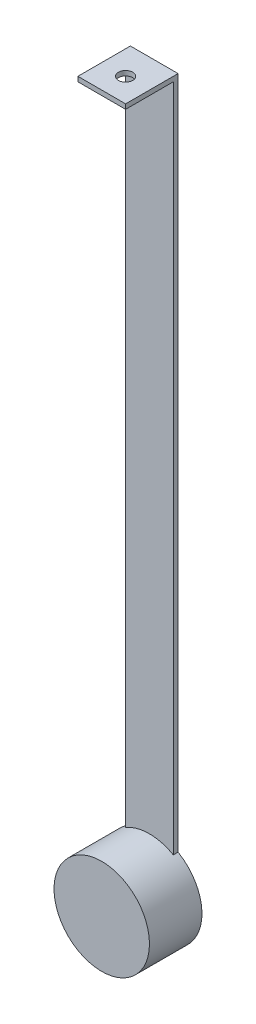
ISO-10303-21;
HEADER;
FILE_DESCRIPTION(('STEP AP214'),'2;1');
FILE_NAME('part.step','',(''),(''),'','','');
FILE_SCHEMA(('AUTOMOTIVE_DESIGN { 1 0 10303 214 1 1 1 1 }'));
ENDSEC;
DATA;
#1=APPLICATION_CONTEXT('core data for automotive mechanical design processes');
#2=APPLICATION_PROTOCOL_DEFINITION('international standard','automotive_design',2000,#1);
#3=PRODUCT_CONTEXT('',#1,'mechanical');
#4=PRODUCT('Part','Part','',(#3));
#5=PRODUCT_RELATED_PRODUCT_CATEGORY('part','',(#4));
#6=PRODUCT_DEFINITION_FORMATION('','',#4);
#7=PRODUCT_DEFINITION_CONTEXT('part definition',#1,'design');
#8=PRODUCT_DEFINITION('design','',#6,#7);
#9=PRODUCT_DEFINITION_SHAPE('','',#8);
#10=(LENGTH_UNIT() NAMED_UNIT(*) SI_UNIT(.MILLI.,.METRE.));
#11=(NAMED_UNIT(*) PLANE_ANGLE_UNIT() SI_UNIT($,.RADIAN.));
#12=(NAMED_UNIT(*) SI_UNIT($,.STERADIAN.) SOLID_ANGLE_UNIT());
#13=UNCERTAINTY_MEASURE_WITH_UNIT(LENGTH_MEASURE(1.E-05),#10,'distance_accuracy_value','');
#14=(GEOMETRIC_REPRESENTATION_CONTEXT(3) GLOBAL_UNCERTAINTY_ASSIGNED_CONTEXT((#13)) GLOBAL_UNIT_ASSIGNED_CONTEXT((#10,
#11,#12)) REPRESENTATION_CONTEXT('',''));
#15=CARTESIAN_POINT('',(0.,0.,0.));
#16=DIRECTION('',(0.,0.,1.));
#17=DIRECTION('',(1.,0.,0.));
#18=AXIS2_PLACEMENT_3D('',#15,#16,#17);
#19=CARTESIAN_POINT('',(0.,0.,1.));
#20=DIRECTION('',(0.,0.,1.));
#21=DIRECTION('',(1.,0.,0.));
#22=AXIS2_PLACEMENT_3D('',#19,#20,#21);
#23=PLANE('',#22);
#24=DIRECTION('',(0.,1.,0.));
#25=VECTOR('',#24,1.);
#26=CARTESIAN_POINT('',(5.,8.66025403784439,1.));
#27=LINE('',#26,#25);
#28=CARTESIAN_POINT('',(5.,8.66025403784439,1.));
#29=VERTEX_POINT('',#28);
#30=CARTESIAN_POINT('',(5.,149.,1.));
#31=VERTEX_POINT('',#30);
#32=EDGE_CURVE('E46',#29,#31,#27,.T.);
#33=ORIENTED_EDGE('',*,*,#32,.T.);
#34=DIRECTION('',(1.,0.,0.));
#35=VECTOR('',#34,1.);
#36=CARTESIAN_POINT('',(-5.,149.,1.));
#37=LINE('',#36,#35);
#38=CARTESIAN_POINT('',(-5.,149.,1.));
#39=VERTEX_POINT('',#38);
#40=EDGE_CURVE('E50',#39,#31,#37,.T.);
#41=ORIENTED_EDGE('',*,*,#40,.F.);
#42=DIRECTION('',(0.,-1.,0.));
#43=VECTOR('',#42,1.);
#44=CARTESIAN_POINT('',(-5.,8.66025403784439,1.));
#45=LINE('',#44,#43);
#46=CARTESIAN_POINT('',(-5.,8.66025403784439,1.));
#47=VERTEX_POINT('',#46);
#48=EDGE_CURVE('E107',#39,#47,#45,.T.);
#49=ORIENTED_EDGE('',*,*,#48,.T.);
#50=CARTESIAN_POINT('',(0.,0.,1.));
#51=DIRECTION('',(0.,0.,-1.));
#52=DIRECTION('',(1.,0.,0.));
#53=AXIS2_PLACEMENT_3D('',#50,#51,#52);
#54=CIRCLE('',#53,10.);
#55=EDGE_CURVE('E120',#47,#29,#54,.T.);
#56=ORIENTED_EDGE('',*,*,#55,.T.);
#57=EDGE_LOOP('',(#33,#41,#49,#56));
#58=FACE_BOUND('',#57,.T.);
#59=ADVANCED_FACE('F31',(#58),#23,.T.);
#60=CARTESIAN_POINT('',(0.,0.,11.));
#61=DIRECTION('',(0.,0.,-1.));
#62=DIRECTION('',(-1.,0.,0.));
#63=AXIS2_PLACEMENT_3D('',#60,#61,#62);
#64=CYLINDRICAL_SURFACE('',#63,10.);
#65=CARTESIAN_POINT('',(0.,0.,11.));
#66=DIRECTION('',(0.,0.,1.));
#67=DIRECTION('',(1.,0.,0.));
#68=AXIS2_PLACEMENT_3D('',#65,#66,#67);
#69=CIRCLE('',#68,10.);
#70=CARTESIAN_POINT('',(10.,0.,11.));
#71=VERTEX_POINT('',#70);
#72=EDGE_CURVE('E11',#71,#71,#69,.T.);
#73=ORIENTED_EDGE('',*,*,#72,.F.);
#74=EDGE_LOOP('',(#73));
#75=FACE_BOUND('',#74,.T.);
#76=DIRECTION('',(0.,0.,-1.));
#77=VECTOR('',#76,1.);
#78=CARTESIAN_POINT('',(-5.,8.66025403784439,1.));
#79=LINE('',#78,#77);
#80=CARTESIAN_POINT('',(-5.,8.66025403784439,0.));
#81=VERTEX_POINT('',#80);
#82=EDGE_CURVE('E129',#47,#81,#79,.T.);
#83=ORIENTED_EDGE('',*,*,#82,.T.);
#84=CARTESIAN_POINT('',(0.,0.,0.));
#85=DIRECTION('',(0.,0.,1.));
#86=DIRECTION('',(1.,0.,0.));
#87=AXIS2_PLACEMENT_3D('',#84,#85,#86);
#88=CIRCLE('',#87,10.);
#89=CARTESIAN_POINT('',(5.,8.66025403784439,0.));
#90=VERTEX_POINT('',#89);
#91=EDGE_CURVE('E39',#81,#90,#88,.T.);
#92=ORIENTED_EDGE('',*,*,#91,.T.);
#93=DIRECTION('',(0.,0.,-1.));
#94=VECTOR('',#93,1.);
#95=CARTESIAN_POINT('',(5.,8.66025403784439,1.));
#96=LINE('',#95,#94);
#97=EDGE_CURVE('E126',#29,#90,#96,.T.);
#98=ORIENTED_EDGE('',*,*,#97,.F.);
#99=ORIENTED_EDGE('',*,*,#55,.F.);
#100=EDGE_LOOP('',(#83,#92,#98,#99));
#101=FACE_BOUND('',#100,.T.);
#102=ADVANCED_FACE('F33',(#75,#101),#64,.T.);
#103=CARTESIAN_POINT('',(0.,0.,11.));
#104=DIRECTION('',(0.,0.,1.));
#105=DIRECTION('',(1.,0.,0.));
#106=AXIS2_PLACEMENT_3D('',#103,#104,#105);
#107=PLANE('',#106);
#108=ORIENTED_EDGE('',*,*,#72,.T.);
#109=EDGE_LOOP('',(#108));
#110=FACE_BOUND('',#109,.T.);
#111=ADVANCED_FACE('F162',(#110),#107,.T.);
#112=CARTESIAN_POINT('',(0.,0.,0.));
#113=DIRECTION('',(0.,0.,1.));
#114=DIRECTION('',(1.,0.,0.));
#115=AXIS2_PLACEMENT_3D('',#112,#113,#114);
#116=PLANE('',#115);
#117=ORIENTED_EDGE('',*,*,#91,.F.);
#118=DIRECTION('',(0.,-1.,0.));
#119=VECTOR('',#118,1.);
#120=CARTESIAN_POINT('',(-5.,8.66025403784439,0.));
#121=LINE('',#120,#119);
#122=CARTESIAN_POINT('',(-5.,150.,0.));
#123=VERTEX_POINT('',#122);
#124=EDGE_CURVE('E111',#123,#81,#121,.T.);
#125=ORIENTED_EDGE('',*,*,#124,.F.);
#126=DIRECTION('',(-1.,0.,0.));
#127=VECTOR('',#126,1.);
#128=CARTESIAN_POINT('',(-5.,150.,0.));
#129=LINE('',#128,#127);
#130=CARTESIAN_POINT('',(5.,150.,0.));
#131=VERTEX_POINT('',#130);
#132=EDGE_CURVE('E108',#131,#123,#129,.T.);
#133=ORIENTED_EDGE('',*,*,#132,.F.);
#134=DIRECTION('',(0.,1.,0.));
#135=VECTOR('',#134,1.);
#136=CARTESIAN_POINT('',(5.,8.66025403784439,0.));
#137=LINE('',#136,#135);
#138=EDGE_CURVE('E117',#90,#131,#137,.T.);
#139=ORIENTED_EDGE('',*,*,#138,.F.);
#140=EDGE_LOOP('',(#117,#125,#133,#139));
#141=FACE_BOUND('',#140,.T.);
#142=ADVANCED_FACE('F140',(#141),#116,.F.);
#143=CARTESIAN_POINT('',(-5.,150.,1.));
#144=DIRECTION('',(0.,-1.,0.));
#145=DIRECTION('',(0.,0.,-1.));
#146=AXIS2_PLACEMENT_3D('',#143,#144,#145);
#147=PLANE('',#146);
#148=CARTESIAN_POINT('',(0.,150.,6.));
#149=DIRECTION('',(0.,1.,0.));
#150=DIRECTION('',(0.,0.,1.));
#151=AXIS2_PLACEMENT_3D('',#148,#149,#150);
#152=CIRCLE('',#151,1.5);
#153=CARTESIAN_POINT('',(0.,150.,7.5));
#154=VERTEX_POINT('',#153);
#155=EDGE_CURVE('E149',#154,#154,#152,.T.);
#156=ORIENTED_EDGE('',*,*,#155,.F.);
#157=EDGE_LOOP('',(#156));
#158=FACE_BOUND('',#157,.T.);
#159=ORIENTED_EDGE('',*,*,#132,.T.);
#160=DIRECTION('',(0.,0.,-1.));
#161=VECTOR('',#160,1.);
#162=CARTESIAN_POINT('',(-5.,150.,1.));
#163=LINE('',#162,#161);
#164=CARTESIAN_POINT('',(-5.,150.,11.));
#165=VERTEX_POINT('',#164);
#166=EDGE_CURVE('E132',#165,#123,#163,.T.);
#167=ORIENTED_EDGE('',*,*,#166,.F.);
#168=DIRECTION('',(-1.,0.,0.));
#169=VECTOR('',#168,1.);
#170=CARTESIAN_POINT('',(-5.,150.,11.));
#171=LINE('',#170,#169);
#172=CARTESIAN_POINT('',(5.,150.,11.));
#173=VERTEX_POINT('',#172);
#174=EDGE_CURVE('E100',#173,#165,#171,.T.);
#175=ORIENTED_EDGE('',*,*,#174,.F.);
#176=DIRECTION('',(0.,0.,-1.));
#177=VECTOR('',#176,1.);
#178=CARTESIAN_POINT('',(5.,150.,1.));
#179=LINE('',#178,#177);
#180=EDGE_CURVE('E123',#173,#131,#179,.T.);
#181=ORIENTED_EDGE('',*,*,#180,.T.);
#182=EDGE_LOOP('',(#159,#167,#175,#181));
#183=FACE_BOUND('',#182,.T.);
#184=ADVANCED_FACE('F142',(#158,#183),#147,.F.);
#185=CARTESIAN_POINT('',(-5.,8.66025403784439,1.));
#186=DIRECTION('',(1.,0.,0.));
#187=DIRECTION('',(0.,0.,-1.));
#188=AXIS2_PLACEMENT_3D('',#185,#186,#187);
#189=PLANE('',#188);
#190=ORIENTED_EDGE('',*,*,#124,.T.);
#191=ORIENTED_EDGE('',*,*,#82,.F.);
#192=ORIENTED_EDGE('',*,*,#48,.F.);
#193=DIRECTION('',(0.,0.,-1.));
#194=VECTOR('',#193,1.);
#195=CARTESIAN_POINT('',(-5.,149.,11.));
#196=LINE('',#195,#194);
#197=CARTESIAN_POINT('',(-5.,149.,11.));
#198=VERTEX_POINT('',#197);
#199=EDGE_CURVE('E87',#198,#39,#196,.T.);
#200=ORIENTED_EDGE('',*,*,#199,.F.);
#201=DIRECTION('',(0.,-1.,0.));
#202=VECTOR('',#201,1.);
#203=CARTESIAN_POINT('',(-5.,150.,11.));
#204=LINE('',#203,#202);
#205=EDGE_CURVE('E94',#165,#198,#204,.T.);
#206=ORIENTED_EDGE('',*,*,#205,.F.);
#207=ORIENTED_EDGE('',*,*,#166,.T.);
#208=EDGE_LOOP('',(#190,#191,#192,#200,#206,#207));
#209=FACE_BOUND('',#208,.T.);
#210=ADVANCED_FACE('F105',(#209),#189,.F.);
#211=CARTESIAN_POINT('',(5.,8.66025403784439,1.));
#212=DIRECTION('',(-1.,0.,0.));
#213=DIRECTION('',(0.,0.,1.));
#214=AXIS2_PLACEMENT_3D('',#211,#212,#213);
#215=PLANE('',#214);
#216=ORIENTED_EDGE('',*,*,#138,.T.);
#217=ORIENTED_EDGE('',*,*,#180,.F.);
#218=DIRECTION('',(0.,1.,0.));
#219=VECTOR('',#218,1.);
#220=CARTESIAN_POINT('',(5.,150.,11.));
#221=LINE('',#220,#219);
#222=CARTESIAN_POINT('',(5.,149.,11.));
#223=VERTEX_POINT('',#222);
#224=EDGE_CURVE('E93',#223,#173,#221,.T.);
#225=ORIENTED_EDGE('',*,*,#224,.F.);
#226=DIRECTION('',(0.,0.,-1.));
#227=VECTOR('',#226,1.);
#228=CARTESIAN_POINT('',(5.,149.,11.));
#229=LINE('',#228,#227);
#230=EDGE_CURVE('E89',#223,#31,#229,.T.);
#231=ORIENTED_EDGE('',*,*,#230,.T.);
#232=ORIENTED_EDGE('',*,*,#32,.F.);
#233=ORIENTED_EDGE('',*,*,#97,.T.);
#234=EDGE_LOOP('',(#216,#217,#225,#231,#232,#233));
#235=FACE_BOUND('',#234,.T.);
#236=ADVANCED_FACE('F138',(#235),#215,.F.);
#237=CARTESIAN_POINT('',(-5.,149.,11.));
#238=DIRECTION('',(0.,1.,0.));
#239=DIRECTION('',(0.,0.,1.));
#240=AXIS2_PLACEMENT_3D('',#237,#238,#239);
#241=PLANE('',#240);
#242=CARTESIAN_POINT('',(0.,149.,6.));
#243=DIRECTION('',(0.,1.,0.));
#244=DIRECTION('',(0.,0.,1.));
#245=AXIS2_PLACEMENT_3D('',#242,#243,#244);
#246=CIRCLE('',#245,1.5);
#247=CARTESIAN_POINT('',(0.,149.,7.5));
#248=VERTEX_POINT('',#247);
#249=EDGE_CURVE('E146',#248,#248,#246,.T.);
#250=ORIENTED_EDGE('',*,*,#249,.T.);
#251=EDGE_LOOP('',(#250));
#252=FACE_BOUND('',#251,.T.);
#253=ORIENTED_EDGE('',*,*,#40,.T.);
#254=ORIENTED_EDGE('',*,*,#230,.F.);
#255=DIRECTION('',(1.,0.,0.));
#256=VECTOR('',#255,1.);
#257=CARTESIAN_POINT('',(-5.,149.,11.));
#258=LINE('',#257,#256);
#259=EDGE_CURVE('E83',#198,#223,#258,.T.);
#260=ORIENTED_EDGE('',*,*,#259,.F.);
#261=ORIENTED_EDGE('',*,*,#199,.T.);
#262=EDGE_LOOP('',(#253,#254,#260,#261));
#263=FACE_BOUND('',#262,.T.);
#264=ADVANCED_FACE('F85',(#252,#263),#241,.F.);
#265=CARTESIAN_POINT('',(-5.,149.,11.));
#266=DIRECTION('',(0.,0.,1.));
#267=DIRECTION('',(1.,0.,0.));
#268=AXIS2_PLACEMENT_3D('',#265,#266,#267);
#269=PLANE('',#268);
#270=ORIENTED_EDGE('',*,*,#205,.T.);
#271=ORIENTED_EDGE('',*,*,#259,.T.);
#272=ORIENTED_EDGE('',*,*,#224,.T.);
#273=ORIENTED_EDGE('',*,*,#174,.T.);
#274=EDGE_LOOP('',(#270,#271,#272,#273));
#275=FACE_BOUND('',#274,.T.);
#276=ADVANCED_FACE('F98',(#275),#269,.T.);
#277=CARTESIAN_POINT('',(0.,149.,6.));
#278=DIRECTION('',(0.,1.,0.));
#279=DIRECTION('',(0.,0.,1.));
#280=AXIS2_PLACEMENT_3D('',#277,#278,#279);
#281=CYLINDRICAL_SURFACE('',#280,1.5);
#282=ORIENTED_EDGE('',*,*,#249,.F.);
#283=EDGE_LOOP('',(#282));
#284=FACE_BOUND('',#283,.T.);
#285=ORIENTED_EDGE('',*,*,#155,.T.);
#286=EDGE_LOOP('',(#285));
#287=FACE_BOUND('',#286,.T.);
#288=ADVANCED_FACE('F153',(#284,#287),#281,.F.);
#289=CLOSED_SHELL('',(#59,#102,#111,#142,#184,#210,#236,#264,#276,#288));
#290=MANIFOLD_SOLID_BREP('B2',#289);
#291=ADVANCED_BREP_SHAPE_REPRESENTATION('',(#18,#290),#14);
#292=SHAPE_DEFINITION_REPRESENTATION(#9,#291);
ENDSEC;
END-ISO-10303-21;
